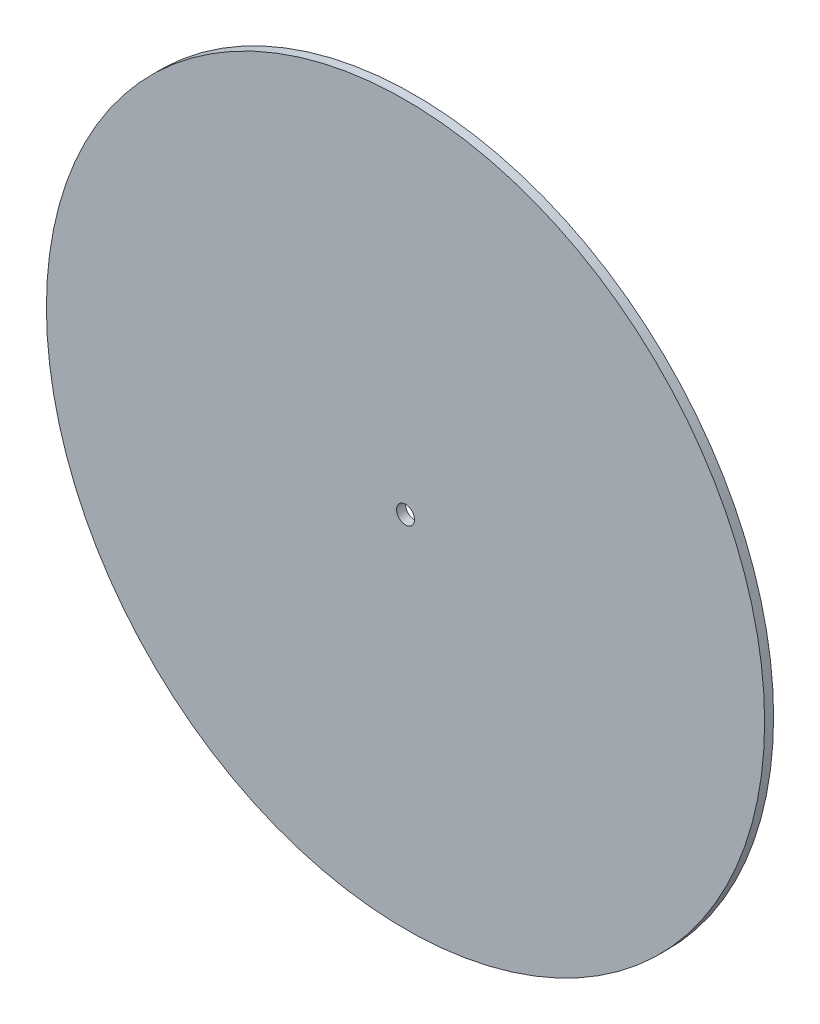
ISO-10303-21;
HEADER;
FILE_DESCRIPTION(('STEP AP214'),'2;1');
FILE_NAME('part.step','',(''),(''),'','','');
FILE_SCHEMA(('AUTOMOTIVE_DESIGN { 1 0 10303 214 1 1 1 1 }'));
ENDSEC;
DATA;
#1=APPLICATION_CONTEXT('core data for automotive mechanical design processes');
#2=APPLICATION_PROTOCOL_DEFINITION('international standard','automotive_design',2000,#1);
#3=PRODUCT_CONTEXT('',#1,'mechanical');
#4=PRODUCT('Part','Part','',(#3));
#5=PRODUCT_RELATED_PRODUCT_CATEGORY('part','',(#4));
#6=PRODUCT_DEFINITION_FORMATION('','',#4);
#7=PRODUCT_DEFINITION_CONTEXT('part definition',#1,'design');
#8=PRODUCT_DEFINITION('design','',#6,#7);
#9=PRODUCT_DEFINITION_SHAPE('','',#8);
#10=(LENGTH_UNIT() NAMED_UNIT(*) SI_UNIT(.MILLI.,.METRE.));
#11=(NAMED_UNIT(*) PLANE_ANGLE_UNIT() SI_UNIT($,.RADIAN.));
#12=(NAMED_UNIT(*) SI_UNIT($,.STERADIAN.) SOLID_ANGLE_UNIT());
#13=UNCERTAINTY_MEASURE_WITH_UNIT(LENGTH_MEASURE(1.E-05),#10,'distance_accuracy_value','');
#14=(GEOMETRIC_REPRESENTATION_CONTEXT(3) GLOBAL_UNCERTAINTY_ASSIGNED_CONTEXT((#13)) GLOBAL_UNIT_ASSIGNED_CONTEXT((#10,
#11,#12)) REPRESENTATION_CONTEXT('',''));
#15=CARTESIAN_POINT('',(0.,0.,0.));
#16=DIRECTION('',(0.,0.,1.));
#17=DIRECTION('',(1.,0.,0.));
#18=AXIS2_PLACEMENT_3D('',#15,#16,#17);
#19=CARTESIAN_POINT('',(0.,0.,1.));
#20=DIRECTION('',(0.,0.,1.));
#21=DIRECTION('',(1.,0.,0.));
#22=AXIS2_PLACEMENT_3D('',#19,#20,#21);
#23=PLANE('',#22);
#24=CARTESIAN_POINT('',(0.,0.,1.));
#25=DIRECTION('',(0.,0.,1.));
#26=DIRECTION('',(1.,0.,0.));
#27=AXIS2_PLACEMENT_3D('',#24,#25,#26);
#28=CIRCLE('',#27,40.);
#29=CARTESIAN_POINT('',(40.,0.,1.));
#30=VERTEX_POINT('',#29);
#31=EDGE_CURVE('E10',#30,#30,#28,.T.);
#32=ORIENTED_EDGE('',*,*,#31,.T.);
#33=EDGE_LOOP('',(#32));
#34=FACE_BOUND('',#33,.T.);
#35=CARTESIAN_POINT('',(0.,0.,1.));
#36=DIRECTION('',(0.,0.,1.));
#37=DIRECTION('',(1.,0.,0.));
#38=AXIS2_PLACEMENT_3D('',#35,#36,#37);
#39=CIRCLE('',#38,1.);
#40=CARTESIAN_POINT('',(1.,0.,1.));
#41=VERTEX_POINT('',#40);
#42=EDGE_CURVE('E48',#41,#41,#39,.T.);
#43=ORIENTED_EDGE('',*,*,#42,.F.);
#44=EDGE_LOOP('',(#43));
#45=FACE_BOUND('',#44,.T.);
#46=ADVANCED_FACE('F37',(#34,#45),#23,.T.);
#47=CARTESIAN_POINT('',(0.,0.,0.));
#48=DIRECTION('',(0.,0.,1.));
#49=DIRECTION('',(1.,0.,0.));
#50=AXIS2_PLACEMENT_3D('',#47,#48,#49);
#51=PLANE('',#50);
#52=CARTESIAN_POINT('',(0.,0.,0.));
#53=DIRECTION('',(0.,0.,1.));
#54=DIRECTION('',(1.,0.,0.));
#55=AXIS2_PLACEMENT_3D('',#52,#53,#54);
#56=CIRCLE('',#55,40.);
#57=CARTESIAN_POINT('',(40.,0.,0.));
#58=VERTEX_POINT('',#57);
#59=EDGE_CURVE('E41',#58,#58,#56,.T.);
#60=ORIENTED_EDGE('',*,*,#59,.F.);
#61=EDGE_LOOP('',(#60));
#62=FACE_BOUND('',#61,.T.);
#63=CARTESIAN_POINT('',(0.,0.,0.));
#64=DIRECTION('',(0.,0.,1.));
#65=DIRECTION('',(1.,0.,0.));
#66=AXIS2_PLACEMENT_3D('',#63,#64,#65);
#67=CIRCLE('',#66,1.);
#68=CARTESIAN_POINT('',(1.,0.,0.));
#69=VERTEX_POINT('',#68);
#70=EDGE_CURVE('E50',#69,#69,#67,.T.);
#71=ORIENTED_EDGE('',*,*,#70,.T.);
#72=EDGE_LOOP('',(#71));
#73=FACE_BOUND('',#72,.T.);
#74=ADVANCED_FACE('F60',(#62,#73),#51,.F.);
#75=CARTESIAN_POINT('',(0.,0.,1.));
#76=DIRECTION('',(0.,0.,-1.));
#77=DIRECTION('',(-1.,0.,0.));
#78=AXIS2_PLACEMENT_3D('',#75,#76,#77);
#79=CYLINDRICAL_SURFACE('',#78,40.);
#80=ORIENTED_EDGE('',*,*,#31,.F.);
#81=EDGE_LOOP('',(#80));
#82=FACE_BOUND('',#81,.T.);
#83=ORIENTED_EDGE('',*,*,#59,.T.);
#84=EDGE_LOOP('',(#83));
#85=FACE_BOUND('',#84,.T.);
#86=ADVANCED_FACE('F39',(#82,#85),#79,.T.);
#87=CARTESIAN_POINT('',(0.,0.,1.));
#88=DIRECTION('',(0.,0.,-1.));
#89=DIRECTION('',(-1.,0.,0.));
#90=AXIS2_PLACEMENT_3D('',#87,#88,#89);
#91=CYLINDRICAL_SURFACE('',#90,1.);
#92=ORIENTED_EDGE('',*,*,#42,.T.);
#93=EDGE_LOOP('',(#92));
#94=FACE_BOUND('',#93,.T.);
#95=ORIENTED_EDGE('',*,*,#70,.F.);
#96=EDGE_LOOP('',(#95));
#97=FACE_BOUND('',#96,.T.);
#98=ADVANCED_FACE('F56',(#94,#97),#91,.F.);
#99=CLOSED_SHELL('',(#46,#74,#86,#98));
#100=MANIFOLD_SOLID_BREP('B2',#99);
#101=ADVANCED_BREP_SHAPE_REPRESENTATION('',(#18,#100),#14);
#102=SHAPE_DEFINITION_REPRESENTATION(#9,#101);
ENDSEC;
END-ISO-10303-21;
